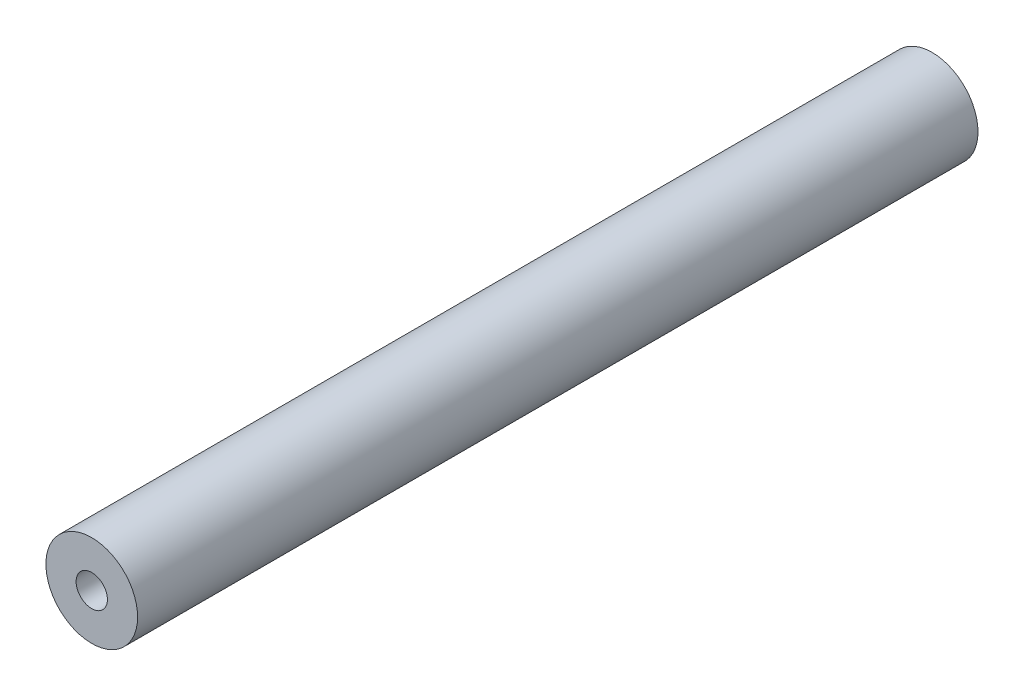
from build123d import *

# Parameters (mm, degrees)
ESBO_O1_R                                     = 3
RESSALTO_EXTRUS_O1_DEPTH                      = 55
BROCA_DE_ROSQUEAR_PARA_TARRAXA_DE_M2_51_D     = 2.05
BROCA_DE_ROSQUEAR_PARA_TARRAXA_DE_M2_51_DEPTH = 4
BROCA_DE_ROSQUEAR_PARA_TARRAXA_DE_M2_51_TIP   = 0.615882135
BROCA_DE_ROSQUEAR_PARA_TARRAXA_DE_M2_52_D     = 2.05
BROCA_DE_ROSQUEAR_PARA_TARRAXA_DE_M2_52_DEPTH = 4
BROCA_DE_ROSQUEAR_PARA_TARRAXA_DE_M2_52_TIP   = 0.615882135


with BuildPart() as part:
    # Esbo_o1 → Ressalto-extrus_o1 (new body)
    with BuildSketch(Plane.XY):
        Circle(ESBO_O1_R)
    extrude(amount=RESSALTO_EXTRUS_O1_DEPTH)

    # Broca de rosquear para tarraxa de M2.51
    with Locations(Plane.XY.offset(55)):
        with Locations((0, 0)):
            Hole(BROCA_DE_ROSQUEAR_PARA_TARRAXA_DE_M2_51_D / 2, depth=BROCA_DE_ROSQUEAR_PARA_TARRAXA_DE_M2_51_DEPTH)
            with Locations((0, 0, -(BROCA_DE_ROSQUEAR_PARA_TARRAXA_DE_M2_51_DEPTH + BROCA_DE_ROSQUEAR_PARA_TARRAXA_DE_M2_51_TIP / 2))):  # 118° drill point
                Cone(0, BROCA_DE_ROSQUEAR_PARA_TARRAXA_DE_M2_51_D / 2, BROCA_DE_ROSQUEAR_PARA_TARRAXA_DE_M2_51_TIP, mode=Mode.SUBTRACT)

    # Broca de rosquear para tarraxa de M2.52
    with Locations(Plane(origin=(0, 0, 0), x_dir=(-1, 0, 0), z_dir=(0, 0, -1))):
        with Locations((0, 0)):
            Hole(BROCA_DE_ROSQUEAR_PARA_TARRAXA_DE_M2_52_D / 2, depth=BROCA_DE_ROSQUEAR_PARA_TARRAXA_DE_M2_52_DEPTH)
            with Locations((0, 0, -(BROCA_DE_ROSQUEAR_PARA_TARRAXA_DE_M2_52_DEPTH + BROCA_DE_ROSQUEAR_PARA_TARRAXA_DE_M2_52_TIP / 2))):  # 118° drill point
                Cone(0, BROCA_DE_ROSQUEAR_PARA_TARRAXA_DE_M2_52_D / 2, BROCA_DE_ROSQUEAR_PARA_TARRAXA_DE_M2_52_TIP, mode=Mode.SUBTRACT)


solid = part.part
